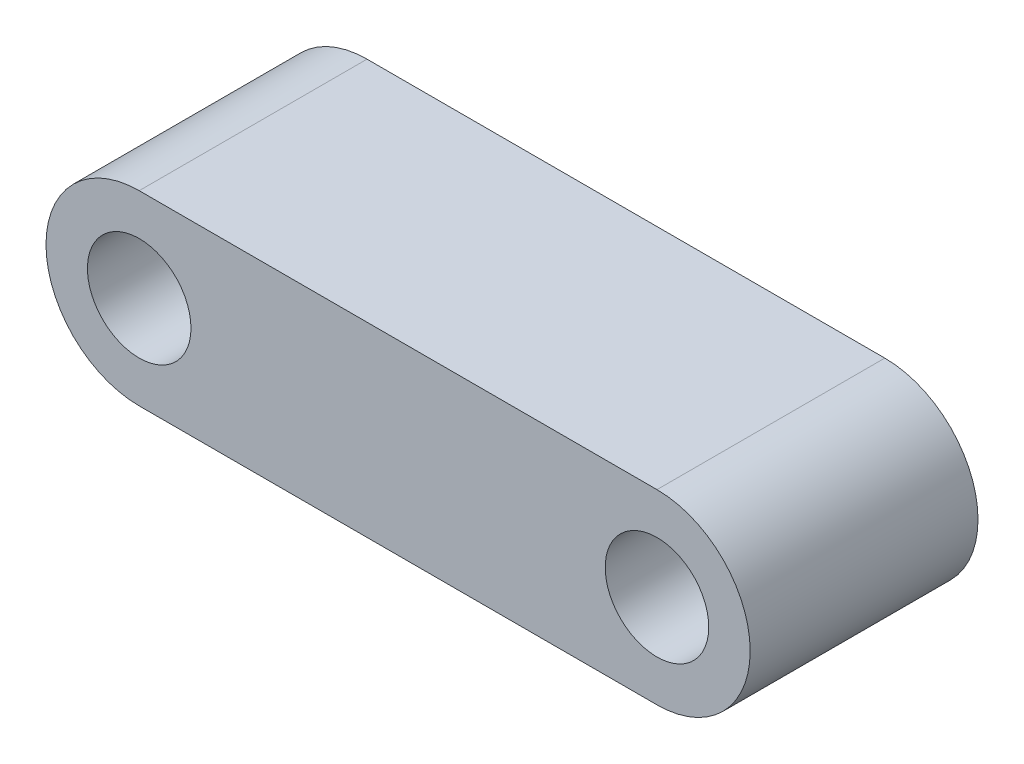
from build123d import *

# Parameters (mm, degrees)
SALIENTE_EXTRUIR1_DEPTH = 11
CROQUIS2_R              = 2.5
CORTAR_EXTRUIR1_DEPTH   = 21.742468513


with BuildPart() as part:
    # Croquis1 → Saliente-Extruir1 (new body)
    with BuildSketch(Plane.XY):
        with BuildLine():
            Line((-12.5, 4.5), (12.5, 4.5))
            ThreePointArc((12.5, 4.5), (17, 0), (12.5, -4.5))
            Line((12.5, -4.5), (-12.5, -4.5))
            ThreePointArc((-12.5, -4.5), (-17, 0), (-12.5, 4.5))
        make_face()
    extrude(amount=SALIENTE_EXTRUIR1_DEPTH)

    # Croquis2 → Cortar-Extruir1 (cut, through all)
    with BuildSketch(Plane.XY.offset(11)):
        with Locations((-12.5, 0)):
            Circle(CROQUIS2_R)
        with Locations((12.5, 0)):
            Circle(CROQUIS2_R)
    extrude(amount=-CORTAR_EXTRUIR1_DEPTH, mode=Mode.SUBTRACT)


solid = part.part
